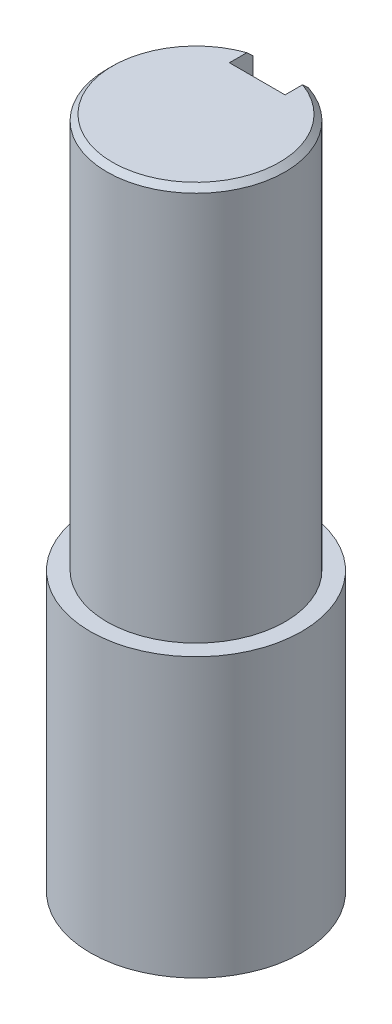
ISO-10303-21;
HEADER;
FILE_DESCRIPTION(('STEP AP214'),'2;1');
FILE_NAME('part.step','',(''),(''),'','','');
FILE_SCHEMA(('AUTOMOTIVE_DESIGN { 1 0 10303 214 1 1 1 1 }'));
ENDSEC;
DATA;
#1=APPLICATION_CONTEXT('core data for automotive mechanical design processes');
#2=APPLICATION_PROTOCOL_DEFINITION('international standard','automotive_design',2000,#1);
#3=PRODUCT_CONTEXT('',#1,'mechanical');
#4=PRODUCT('Part','Part','',(#3));
#5=PRODUCT_RELATED_PRODUCT_CATEGORY('part','',(#4));
#6=PRODUCT_DEFINITION_FORMATION('','',#4);
#7=PRODUCT_DEFINITION_CONTEXT('part definition',#1,'design');
#8=PRODUCT_DEFINITION('design','',#6,#7);
#9=PRODUCT_DEFINITION_SHAPE('','',#8);
#10=(LENGTH_UNIT() NAMED_UNIT(*) SI_UNIT(.MILLI.,.METRE.));
#11=(NAMED_UNIT(*) PLANE_ANGLE_UNIT() SI_UNIT($,.RADIAN.));
#12=(NAMED_UNIT(*) SI_UNIT($,.STERADIAN.) SOLID_ANGLE_UNIT());
#13=UNCERTAINTY_MEASURE_WITH_UNIT(LENGTH_MEASURE(1.E-05),#10,'distance_accuracy_value','');
#14=(GEOMETRIC_REPRESENTATION_CONTEXT(3) GLOBAL_UNCERTAINTY_ASSIGNED_CONTEXT((#13)) GLOBAL_UNIT_ASSIGNED_CONTEXT((#10,
#11,#12)) REPRESENTATION_CONTEXT('',''));
#15=CARTESIAN_POINT('',(0.,0.,0.));
#16=DIRECTION('',(0.,0.,1.));
#17=DIRECTION('',(1.,0.,0.));
#18=AXIS2_PLACEMENT_3D('',#15,#16,#17);
#19=CARTESIAN_POINT('',(0.,71.,0.));
#20=DIRECTION('',(0.,-1.,0.));
#21=DIRECTION('',(0.,0.,-1.));
#22=AXIS2_PLACEMENT_3D('',#19,#20,#21);
#23=CYLINDRICAL_SURFACE('',#22,16.);
#24=DIRECTION('',(0.,-1.,0.));
#25=VECTOR('',#24,1.);
#26=CARTESIAN_POINT('',(5.,71.,-15.1986841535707));
#27=LINE('',#26,#25);
#28=CARTESIAN_POINT('',(5.,4.99999999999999,-15.1986841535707));
#29=VERTEX_POINT('',#28);
#30=CARTESIAN_POINT('',(5.,70.,-15.1986841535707));
#31=VERTEX_POINT('',#30);
#32=EDGE_CURVE('E142',#29,#31,#27,.F.);
#33=ORIENTED_EDGE('',*,*,#32,.T.);
#34=CARTESIAN_POINT('',(0.,70.,0.));
#35=DIRECTION('',(0.,1.,0.));
#36=DIRECTION('',(0.,0.,1.));
#37=AXIS2_PLACEMENT_3D('',#34,#35,#36);
#38=CIRCLE('',#37,16.);
#39=CARTESIAN_POINT('',(-5.,70.,-15.1986841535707));
#40=VERTEX_POINT('',#39);
#41=EDGE_CURVE('E62',#31,#40,#38,.F.);
#42=ORIENTED_EDGE('',*,*,#41,.T.);
#43=DIRECTION('',(0.,-1.,0.));
#44=VECTOR('',#43,1.);
#45=CARTESIAN_POINT('',(-5.,71.,-15.1986841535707));
#46=LINE('',#45,#44);
#47=CARTESIAN_POINT('',(-5.,4.99999999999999,-15.1986841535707));
#48=VERTEX_POINT('',#47);
#49=EDGE_CURVE('E138',#40,#48,#46,.T.);
#50=ORIENTED_EDGE('',*,*,#49,.T.);
#51=CARTESIAN_POINT('',(0.,4.99999999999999,0.));
#52=DIRECTION('',(0.,1.,0.));
#53=DIRECTION('',(0.,0.,1.));
#54=AXIS2_PLACEMENT_3D('',#51,#52,#53);
#55=CIRCLE('',#54,16.);
#56=EDGE_CURVE('E107',#29,#48,#55,.T.);
#57=ORIENTED_EDGE('',*,*,#56,.F.);
#58=EDGE_LOOP('',(#33,#42,#50,#57));
#59=FACE_BOUND('',#58,.T.);
#60=CARTESIAN_POINT('',(0.,0.,0.));
#61=DIRECTION('',(0.,1.,0.));
#62=DIRECTION('',(0.,0.,1.));
#63=AXIS2_PLACEMENT_3D('',#60,#61,#62);
#64=CIRCLE('',#63,16.);
#65=CARTESIAN_POINT('',(0.,0.,16.));
#66=VERTEX_POINT('',#65);
#67=EDGE_CURVE('E134',#66,#66,#64,.T.);
#68=ORIENTED_EDGE('',*,*,#67,.T.);
#69=EDGE_LOOP('',(#68));
#70=FACE_BOUND('',#69,.T.);
#71=ADVANCED_FACE('F46',(#59,#70),#23,.T.);
#72=CARTESIAN_POINT('',(0.,71.,0.));
#73=DIRECTION('',(0.,1.,0.));
#74=DIRECTION('',(0.,0.,1.));
#75=AXIS2_PLACEMENT_3D('',#72,#73,#74);
#76=PLANE('',#75);
#77=DIRECTION('',(0.,0.,1.));
#78=VECTOR('',#77,1.);
#79=CARTESIAN_POINT('',(-5.,71.,0.));
#80=LINE('',#79,#78);
#81=CARTESIAN_POINT('',(-5.,71.,-14.142135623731));
#82=VERTEX_POINT('',#81);
#83=CARTESIAN_POINT('',(-5.,71.,-11.));
#84=VERTEX_POINT('',#83);
#85=EDGE_CURVE('E116',#82,#84,#80,.T.);
#86=ORIENTED_EDGE('',*,*,#85,.F.);
#87=CARTESIAN_POINT('',(0.,71.,0.));
#88=DIRECTION('',(0.,1.,0.));
#89=DIRECTION('',(0.,0.,1.));
#90=AXIS2_PLACEMENT_3D('',#87,#88,#89);
#91=CIRCLE('',#90,15.);
#92=CARTESIAN_POINT('',(5.,71.,-14.142135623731));
#93=VERTEX_POINT('',#92);
#94=EDGE_CURVE('E153',#82,#93,#91,.T.);
#95=ORIENTED_EDGE('',*,*,#94,.T.);
#96=DIRECTION('',(0.,0.,-1.));
#97=VECTOR('',#96,1.);
#98=CARTESIAN_POINT('',(5.,71.,-21.));
#99=LINE('',#98,#97);
#100=CARTESIAN_POINT('',(5.,71.,-11.));
#101=VERTEX_POINT('',#100);
#102=EDGE_CURVE('E130',#101,#93,#99,.T.);
#103=ORIENTED_EDGE('',*,*,#102,.F.);
#104=DIRECTION('',(1.,0.,0.));
#105=VECTOR('',#104,1.);
#106=CARTESIAN_POINT('',(-5.,71.,-11.));
#107=LINE('',#106,#105);
#108=EDGE_CURVE('E133',#84,#101,#107,.T.);
#109=ORIENTED_EDGE('',*,*,#108,.F.);
#110=EDGE_LOOP('',(#86,#95,#103,#109));
#111=FACE_BOUND('',#110,.T.);
#112=ADVANCED_FACE('F169',(#111),#76,.T.);
#113=CARTESIAN_POINT('',(0.,4.99999999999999,0.));
#114=DIRECTION('',(0.,1.,0.));
#115=DIRECTION('',(0.,0.,1.));
#116=AXIS2_PLACEMENT_3D('',#113,#114,#115);
#117=PLANE('',#116);
#118=ORIENTED_EDGE('',*,*,#56,.T.);
#119=DIRECTION('',(0.,0.,1.));
#120=VECTOR('',#119,1.);
#121=CARTESIAN_POINT('',(-5.,4.99999999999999,-21.));
#122=LINE('',#121,#120);
#123=CARTESIAN_POINT('',(-5.,4.99999999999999,-11.));
#124=VERTEX_POINT('',#123);
#125=EDGE_CURVE('E100',#48,#124,#122,.T.);
#126=ORIENTED_EDGE('',*,*,#125,.T.);
#127=DIRECTION('',(1.,0.,0.));
#128=VECTOR('',#127,1.);
#129=CARTESIAN_POINT('',(-5.,4.99999999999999,-11.));
#130=LINE('',#129,#128);
#131=CARTESIAN_POINT('',(5.,4.99999999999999,-11.));
#132=VERTEX_POINT('',#131);
#133=EDGE_CURVE('E105',#124,#132,#130,.T.);
#134=ORIENTED_EDGE('',*,*,#133,.T.);
#135=DIRECTION('',(0.,0.,-1.));
#136=VECTOR('',#135,1.);
#137=CARTESIAN_POINT('',(5.,4.99999999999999,-21.));
#138=LINE('',#137,#136);
#139=EDGE_CURVE('E110',#132,#29,#138,.T.);
#140=ORIENTED_EDGE('',*,*,#139,.T.);
#141=EDGE_LOOP('',(#118,#126,#134,#140));
#142=FACE_BOUND('',#141,.T.);
#143=ADVANCED_FACE('F102',(#142),#117,.T.);
#144=CARTESIAN_POINT('',(5.,4.99999999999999,-21.));
#145=DIRECTION('',(1.,0.,0.));
#146=DIRECTION('',(0.,0.,-1.));
#147=AXIS2_PLACEMENT_3D('',#144,#145,#146);
#148=PLANE('',#147);
#149=ORIENTED_EDGE('',*,*,#102,.T.);
#150=CARTESIAN_POINT('',(5.,71.,-14.142135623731));
#151=CARTESIAN_POINT('',(5.,70.833663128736,-14.3185391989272));
#152=CARTESIAN_POINT('',(5.,70.6671613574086,-14.4947866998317));
#153=CARTESIAN_POINT('',(5.,70.3338280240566,-14.8469695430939));
#154=CARTESIAN_POINT('',(5.,70.1669964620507,-15.0229048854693));
#155=CARTESIAN_POINT('',(5.,70.,-15.1986841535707));
#156=B_SPLINE_CURVE_WITH_KNOTS('',3,(#150,#151,#152,#153,#154,#155),.UNSPECIFIED.,.F.,.F.,(4,2,
4),(0.,0.72737486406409,1.45474968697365),.UNSPECIFIED.);
#157=EDGE_CURVE('E76',#93,#31,#156,.T.);
#158=ORIENTED_EDGE('',*,*,#157,.T.);
#159=ORIENTED_EDGE('',*,*,#32,.F.);
#160=ORIENTED_EDGE('',*,*,#139,.F.);
#161=DIRECTION('',(0.,1.,0.));
#162=VECTOR('',#161,1.);
#163=CARTESIAN_POINT('',(5.,4.99999999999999,-11.));
#164=LINE('',#163,#162);
#165=EDGE_CURVE('E121',#132,#101,#164,.T.);
#166=ORIENTED_EDGE('',*,*,#165,.T.);
#167=EDGE_LOOP('',(#149,#158,#159,#160,#166));
#168=FACE_BOUND('',#167,.T.);
#169=ADVANCED_FACE('F163',(#168),#148,.F.);
#170=CARTESIAN_POINT('',(-5.,4.99999999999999,-21.));
#171=DIRECTION('',(-1.,0.,0.));
#172=DIRECTION('',(0.,0.,1.));
#173=AXIS2_PLACEMENT_3D('',#170,#171,#172);
#174=PLANE('',#173);
#175=ORIENTED_EDGE('',*,*,#49,.F.);
#176=CARTESIAN_POINT('',(-5.,70.,-15.1986841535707));
#177=CARTESIAN_POINT('',(-5.,70.1669964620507,-15.0229048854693));
#178=CARTESIAN_POINT('',(-5.,70.3338280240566,-14.8469695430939));
#179=CARTESIAN_POINT('',(-5.,70.6671613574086,-14.4947866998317));
#180=CARTESIAN_POINT('',(-5.,70.833663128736,-14.3185391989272));
#181=CARTESIAN_POINT('',(-5.,71.,-14.142135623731));
#182=B_SPLINE_CURVE_WITH_KNOTS('',3,(#176,#177,#178,#179,#180,#181),.UNSPECIFIED.,.F.,.F.,(4,2,
4),(0.,0.727374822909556,1.45474968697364),.UNSPECIFIED.);
#183=EDGE_CURVE('E11',#40,#82,#182,.T.);
#184=ORIENTED_EDGE('',*,*,#183,.T.);
#185=ORIENTED_EDGE('',*,*,#85,.T.);
#186=DIRECTION('',(0.,1.,0.));
#187=VECTOR('',#186,1.);
#188=CARTESIAN_POINT('',(-5.,4.99999999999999,-11.));
#189=LINE('',#188,#187);
#190=EDGE_CURVE('E113',#124,#84,#189,.T.);
#191=ORIENTED_EDGE('',*,*,#190,.F.);
#192=ORIENTED_EDGE('',*,*,#125,.F.);
#193=EDGE_LOOP('',(#175,#184,#185,#191,#192));
#194=FACE_BOUND('',#193,.T.);
#195=ADVANCED_FACE('F114',(#194),#174,.F.);
#196=CARTESIAN_POINT('',(-5.,4.99999999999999,-11.));
#197=DIRECTION('',(0.,0.,1.));
#198=DIRECTION('',(1.,0.,0.));
#199=AXIS2_PLACEMENT_3D('',#196,#197,#198);
#200=PLANE('',#199);
#201=ORIENTED_EDGE('',*,*,#108,.T.);
#202=ORIENTED_EDGE('',*,*,#165,.F.);
#203=ORIENTED_EDGE('',*,*,#133,.F.);
#204=ORIENTED_EDGE('',*,*,#190,.T.);
#205=EDGE_LOOP('',(#201,#202,#203,#204));
#206=FACE_BOUND('',#205,.T.);
#207=ADVANCED_FACE('F123',(#206),#200,.F.);
#208=CARTESIAN_POINT('',(0.,-50.,0.));
#209=DIRECTION('',(0.,1.,0.));
#210=DIRECTION('',(0.,0.,1.));
#211=AXIS2_PLACEMENT_3D('',#208,#209,#210);
#212=CYLINDRICAL_SURFACE('',#211,19.);
#213=CARTESIAN_POINT('',(0.,-50.,0.));
#214=DIRECTION('',(0.,-1.,0.));
#215=DIRECTION('',(0.,0.,-1.));
#216=AXIS2_PLACEMENT_3D('',#213,#214,#215);
#217=CIRCLE('',#216,19.);
#218=CARTESIAN_POINT('',(0.,-50.,-19.));
#219=VERTEX_POINT('',#218);
#220=EDGE_CURVE('E148',#219,#219,#217,.T.);
#221=ORIENTED_EDGE('',*,*,#220,.F.);
#222=EDGE_LOOP('',(#221));
#223=FACE_BOUND('',#222,.T.);
#224=CARTESIAN_POINT('',(0.,0.,0.));
#225=DIRECTION('',(0.,-1.,0.));
#226=DIRECTION('',(0.,0.,-1.));
#227=AXIS2_PLACEMENT_3D('',#224,#225,#226);
#228=CIRCLE('',#227,19.);
#229=CARTESIAN_POINT('',(0.,0.,-19.));
#230=VERTEX_POINT('',#229);
#231=EDGE_CURVE('E185',#230,#230,#228,.T.);
#232=ORIENTED_EDGE('',*,*,#231,.T.);
#233=EDGE_LOOP('',(#232));
#234=FACE_BOUND('',#233,.T.);
#235=ADVANCED_FACE('F224',(#223,#234),#212,.T.);
#236=CARTESIAN_POINT('',(0.,-50.,0.));
#237=DIRECTION('',(0.,-1.,0.));
#238=DIRECTION('',(0.,0.,-1.));
#239=AXIS2_PLACEMENT_3D('',#236,#237,#238);
#240=PLANE('',#239);
#241=ORIENTED_EDGE('',*,*,#220,.T.);
#242=EDGE_LOOP('',(#241));
#243=FACE_BOUND('',#242,.T.);
#244=ADVANCED_FACE('F181',(#243),#240,.T.);
#245=CARTESIAN_POINT('',(0.,0.,0.));
#246=DIRECTION('',(0.,-1.,0.));
#247=DIRECTION('',(0.,0.,-1.));
#248=AXIS2_PLACEMENT_3D('',#245,#246,#247);
#249=PLANE('',#248);
#250=ORIENTED_EDGE('',*,*,#67,.F.);
#251=EDGE_LOOP('',(#250));
#252=FACE_BOUND('',#251,.T.);
#253=ORIENTED_EDGE('',*,*,#231,.F.);
#254=EDGE_LOOP('',(#253));
#255=FACE_BOUND('',#254,.T.);
#256=ADVANCED_FACE('F178',(#252,#255),#249,.F.);
#257=CARTESIAN_POINT('',(0.,71.,0.));
#258=DIRECTION('',(0.,-1.,0.));
#259=DIRECTION('',(0.,0.,-1.));
#260=AXIS2_PLACEMENT_3D('',#257,#258,#259);
#261=CONICAL_SURFACE('',#260,15.,0.785398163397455);
#262=ORIENTED_EDGE('',*,*,#183,.F.);
#263=ORIENTED_EDGE('',*,*,#41,.F.);
#264=ORIENTED_EDGE('',*,*,#157,.F.);
#265=ORIENTED_EDGE('',*,*,#94,.F.);
#266=EDGE_LOOP('',(#262,#263,#264,#265));
#267=FACE_BOUND('',#266,.T.);
#268=ADVANCED_FACE('F49',(#267),#261,.T.);
#269=CLOSED_SHELL('',(#71,#112,#143,#169,#195,#207,#235,#244,#256,#268));
#270=MANIFOLD_SOLID_BREP('B2',#269);
#271=ADVANCED_BREP_SHAPE_REPRESENTATION('',(#18,#270),#14);
#272=SHAPE_DEFINITION_REPRESENTATION(#9,#271);
ENDSEC;
END-ISO-10303-21;
